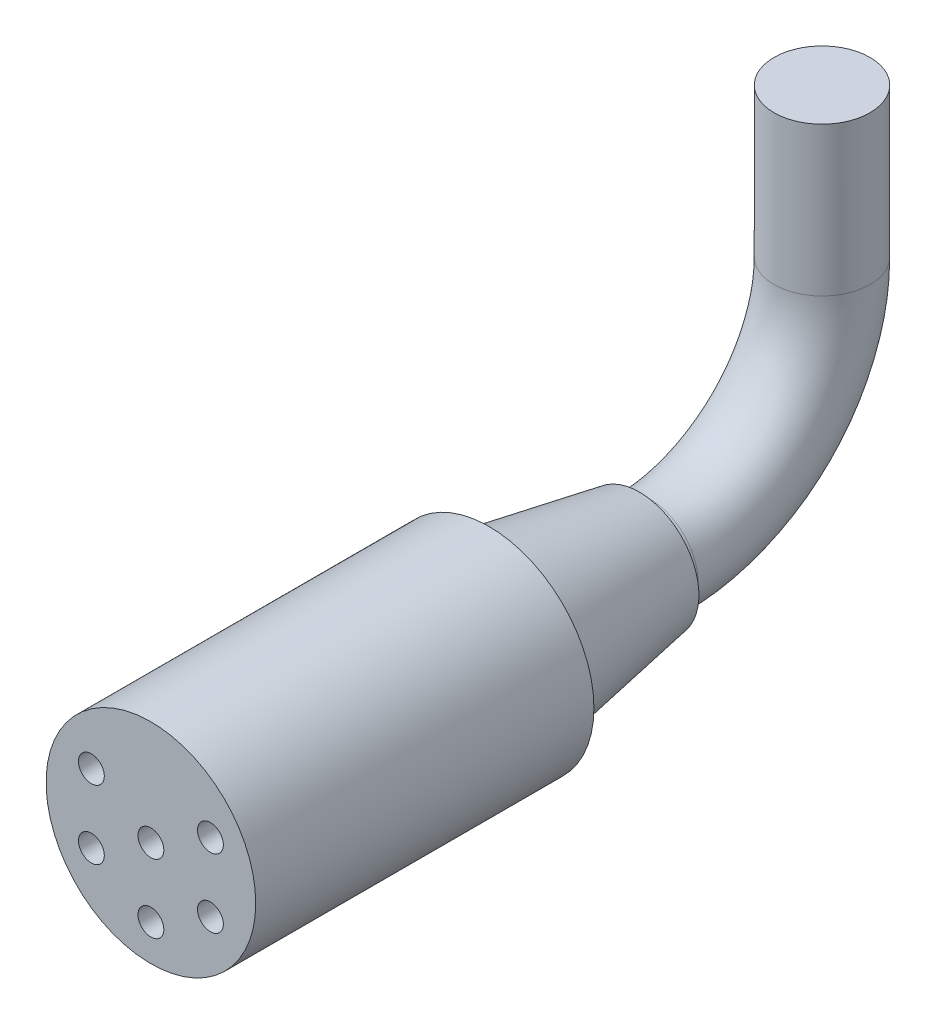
ISO-10303-21;
HEADER;
FILE_DESCRIPTION(('STEP AP214'),'2;1');
FILE_NAME('part.step','',(''),(''),'','','');
FILE_SCHEMA(('AUTOMOTIVE_DESIGN { 1 0 10303 214 1 1 1 1 }'));
ENDSEC;
DATA;
#1=APPLICATION_CONTEXT('core data for automotive mechanical design processes');
#2=APPLICATION_PROTOCOL_DEFINITION('international standard','automotive_design',2000,#1);
#3=PRODUCT_CONTEXT('',#1,'mechanical');
#4=PRODUCT('Part','Part','',(#3));
#5=PRODUCT_RELATED_PRODUCT_CATEGORY('part','',(#4));
#6=PRODUCT_DEFINITION_FORMATION('','',#4);
#7=PRODUCT_DEFINITION_CONTEXT('part definition',#1,'design');
#8=PRODUCT_DEFINITION('design','',#6,#7);
#9=PRODUCT_DEFINITION_SHAPE('','',#8);
#10=(LENGTH_UNIT() NAMED_UNIT(*) SI_UNIT(.MILLI.,.METRE.));
#11=(NAMED_UNIT(*) PLANE_ANGLE_UNIT() SI_UNIT($,.RADIAN.));
#12=(NAMED_UNIT(*) SI_UNIT($,.STERADIAN.) SOLID_ANGLE_UNIT());
#13=UNCERTAINTY_MEASURE_WITH_UNIT(LENGTH_MEASURE(1.E-05),#10,'distance_accuracy_value','');
#14=(GEOMETRIC_REPRESENTATION_CONTEXT(3) GLOBAL_UNCERTAINTY_ASSIGNED_CONTEXT((#13)) GLOBAL_UNIT_ASSIGNED_CONTEXT((#10,
#11,#12)) REPRESENTATION_CONTEXT('',''));
#15=CARTESIAN_POINT('',(0.,0.,0.));
#16=DIRECTION('',(0.,0.,1.));
#17=DIRECTION('',(1.,0.,0.));
#18=AXIS2_PLACEMENT_3D('',#15,#16,#17);
#19=CARTESIAN_POINT('',(0.,0.,-36.112500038));
#20=DIRECTION('',(0.,0.,-1.));
#21=DIRECTION('',(-1.,0.,0.));
#22=AXIS2_PLACEMENT_3D('',#19,#20,#21);
#23=PLANE('',#22);
#24=CARTESIAN_POINT('',(0.,0.,-36.112500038));
#25=DIRECTION('',(0.,0.,-1.));
#26=DIRECTION('',(-1.,0.,0.));
#27=AXIS2_PLACEMENT_3D('',#24,#25,#26);
#28=CIRCLE('',#27,4.39337397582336);
#29=CARTESIAN_POINT('',(-4.39337397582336,0.,-36.112500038));
#30=VERTEX_POINT('',#29);
#31=EDGE_CURVE('E87',#30,#30,#28,.T.);
#32=ORIENTED_EDGE('',*,*,#31,.T.);
#33=EDGE_LOOP('',(#32));
#34=FACE_BOUND('',#33,.T.);
#35=CARTESIAN_POINT('',(0.,0.,-36.112500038));
#36=DIRECTION('',(0.,0.,-1.));
#37=DIRECTION('',(-1.,0.,0.));
#38=AXIS2_PLACEMENT_3D('',#35,#36,#37);
#39=CIRCLE('',#38,3.5433);
#40=CARTESIAN_POINT('',(-3.5433,0.,-36.112500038));
#41=VERTEX_POINT('',#40);
#42=EDGE_CURVE('E93',#41,#41,#39,.T.);
#43=ORIENTED_EDGE('',*,*,#42,.F.);
#44=EDGE_LOOP('',(#43));
#45=FACE_BOUND('',#44,.T.);
#46=ADVANCED_FACE('F36',(#34,#45),#23,.T.);
#47=CARTESIAN_POINT('',(0.,0.,-25.000000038));
#48=DIRECTION('',(0.,0.,1.));
#49=DIRECTION('',(1.,0.,0.));
#50=AXIS2_PLACEMENT_3D('',#47,#48,#49);
#51=PLANE('',#50);
#52=CARTESIAN_POINT('',(0.,0.,-25.000000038));
#53=DIRECTION('',(0.,0.,1.));
#54=DIRECTION('',(1.,0.,0.));
#55=AXIS2_PLACEMENT_3D('',#52,#53,#54);
#56=CIRCLE('',#55,7.747);
#57=CARTESIAN_POINT('',(7.747,0.,-25.000000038));
#58=VERTEX_POINT('',#57);
#59=EDGE_CURVE('E43',#58,#58,#56,.T.);
#60=ORIENTED_EDGE('',*,*,#59,.F.);
#61=EDGE_LOOP('',(#60));
#62=FACE_BOUND('',#61,.T.);
#63=CARTESIAN_POINT('',(0.,0.,-25.000000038));
#64=DIRECTION('',(0.,0.,1.));
#65=DIRECTION('',(1.,0.,0.));
#66=AXIS2_PLACEMENT_3D('',#63,#64,#65);
#67=CIRCLE('',#66,6.35280754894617);
#68=CARTESIAN_POINT('',(6.35280754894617,0.,-25.000000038));
#69=VERTEX_POINT('',#68);
#70=EDGE_CURVE('E10',#69,#69,#67,.F.);
#71=ORIENTED_EDGE('',*,*,#70,.F.);
#72=EDGE_LOOP('',(#71));
#73=FACE_BOUND('',#72,.T.);
#74=ADVANCED_FACE('F127',(#62,#73),#51,.F.);
#75=CARTESIAN_POINT('',(0.,0.,-25.000000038));
#76=DIRECTION('',(0.,0.,1.));
#77=DIRECTION('',(1.,0.,0.));
#78=AXIS2_PLACEMENT_3D('',#75,#76,#77);
#79=CYLINDRICAL_SURFACE('',#78,7.747);
#80=ORIENTED_EDGE('',*,*,#59,.T.);
#81=EDGE_LOOP('',(#80));
#82=FACE_BOUND('',#81,.T.);
#83=CARTESIAN_POINT('',(0.,0.,0.));
#84=DIRECTION('',(0.,0.,1.));
#85=DIRECTION('',(1.,0.,0.));
#86=AXIS2_PLACEMENT_3D('',#83,#84,#85);
#87=CIRCLE('',#86,7.747);
#88=CARTESIAN_POINT('',(7.747,0.,0.));
#89=VERTEX_POINT('',#88);
#90=EDGE_CURVE('E47',#89,#89,#87,.T.);
#91=ORIENTED_EDGE('',*,*,#90,.F.);
#92=EDGE_LOOP('',(#91));
#93=FACE_BOUND('',#92,.T.);
#94=ADVANCED_FACE('F38',(#82,#93),#79,.T.);
#95=CARTESIAN_POINT('',(0.,0.,0.));
#96=DIRECTION('',(0.,0.,1.));
#97=DIRECTION('',(1.,0.,0.));
#98=AXIS2_PLACEMENT_3D('',#95,#96,#97);
#99=PLANE('',#98);
#100=CARTESIAN_POINT('',(0.,0.,0.));
#101=DIRECTION('',(0.,0.,1.));
#102=DIRECTION('',(1.,0.,0.));
#103=AXIS2_PLACEMENT_3D('',#100,#101,#102);
#104=CIRCLE('',#103,0.955);
#105=CARTESIAN_POINT('',(0.955,0.,0.));
#106=VERTEX_POINT('',#105);
#107=EDGE_CURVE('E84',#106,#106,#104,.T.);
#108=ORIENTED_EDGE('',*,*,#107,.F.);
#109=EDGE_LOOP('',(#108));
#110=FACE_BOUND('',#109,.T.);
#111=CARTESIAN_POINT('',(-4.39940905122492,-2.54000000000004,0.));
#112=DIRECTION('',(0.,0.,1.));
#113=DIRECTION('',(0.50000000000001,-0.866025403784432,0.));
#114=AXIS2_PLACEMENT_3D('',#111,#112,#113);
#115=CIRCLE('',#114,0.955);
#116=CARTESIAN_POINT('',(-3.92190905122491,-3.36705426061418,0.));
#117=VERTEX_POINT('',#116);
#118=EDGE_CURVE('E80',#117,#117,#115,.T.);
#119=ORIENTED_EDGE('',*,*,#118,.F.);
#120=EDGE_LOOP('',(#119));
#121=FACE_BOUND('',#120,.T.);
#122=CARTESIAN_POINT('',(-4.399409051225,2.53999999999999,0.));
#123=DIRECTION('',(0.,0.,1.));
#124=DIRECTION('',(-0.499999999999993,-0.866025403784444,0.));
#125=AXIS2_PLACEMENT_3D('',#122,#123,#124);
#126=CIRCLE('',#125,0.955);
#127=CARTESIAN_POINT('',(-4.876909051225,1.71294573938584,0.));
#128=VERTEX_POINT('',#127);
#129=EDGE_CURVE('E74',#128,#128,#126,.T.);
#130=ORIENTED_EDGE('',*,*,#129,.F.);
#131=EDGE_LOOP('',(#130));
#132=FACE_BOUND('',#131,.T.);
#133=CARTESIAN_POINT('',(4.39940905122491,2.54000000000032,0.));
#134=DIRECTION('',(0.,0.,1.));
#135=DIRECTION('',(-0.500000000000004,0.866025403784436,0.));
#136=AXIS2_PLACEMENT_3D('',#133,#134,#135);
#137=CIRCLE('',#136,0.955);
#138=CARTESIAN_POINT('',(3.9219090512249,3.36705426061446,0.));
#139=VERTEX_POINT('',#138);
#140=EDGE_CURVE('E68',#139,#139,#137,.T.);
#141=ORIENTED_EDGE('',*,*,#140,.F.);
#142=EDGE_LOOP('',(#141));
#143=FACE_BOUND('',#142,.T.);
#144=CARTESIAN_POINT('',(4.39940905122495,-2.53999999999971,0.));
#145=DIRECTION('',(0.,0.,1.));
#146=DIRECTION('',(0.499999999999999,0.86602540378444,0.));
#147=AXIS2_PLACEMENT_3D('',#144,#145,#146);
#148=CIRCLE('',#147,0.955);
#149=CARTESIAN_POINT('',(4.87690905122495,-1.71294573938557,0.));
#150=VERTEX_POINT('',#149);
#151=EDGE_CURVE('E62',#150,#150,#148,.T.);
#152=ORIENTED_EDGE('',*,*,#151,.F.);
#153=EDGE_LOOP('',(#152));
#154=FACE_BOUND('',#153,.T.);
#155=CARTESIAN_POINT('',(0.,-5.07999999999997,0.));
#156=DIRECTION('',(0.,0.,1.));
#157=DIRECTION('',(1.,0.,0.));
#158=AXIS2_PLACEMENT_3D('',#155,#156,#157);
#159=CIRCLE('',#158,0.955);
#160=CARTESIAN_POINT('',(0.955,-5.07999999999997,0.));
#161=VERTEX_POINT('',#160);
#162=EDGE_CURVE('E54',#161,#161,#159,.T.);
#163=ORIENTED_EDGE('',*,*,#162,.F.);
#164=EDGE_LOOP('',(#163));
#165=FACE_BOUND('',#164,.T.);
#166=ORIENTED_EDGE('',*,*,#90,.T.);
#167=EDGE_LOOP('',(#166));
#168=FACE_BOUND('',#167,.T.);
#169=ADVANCED_FACE('F185',(#110,#121,#132,#143,#154,#165,#168),#99,.T.);
#170=CARTESIAN_POINT('',(0.,-5.07999999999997,-10.));
#171=DIRECTION('',(0.,0.,1.));
#172=DIRECTION('',(1.,0.,0.));
#173=AXIS2_PLACEMENT_3D('',#170,#171,#172);
#174=CYLINDRICAL_SURFACE('',#173,0.955);
#175=CARTESIAN_POINT('',(0.,-5.07999999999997,-10.));
#176=DIRECTION('',(0.,0.,1.));
#177=DIRECTION('',(1.,0.,0.));
#178=AXIS2_PLACEMENT_3D('',#175,#176,#177);
#179=CIRCLE('',#178,0.955);
#180=CARTESIAN_POINT('',(0.955,-5.07999999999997,-10.));
#181=VERTEX_POINT('',#180);
#182=EDGE_CURVE('E52',#181,#181,#179,.T.);
#183=ORIENTED_EDGE('',*,*,#182,.F.);
#184=EDGE_LOOP('',(#183));
#185=FACE_BOUND('',#184,.T.);
#186=ORIENTED_EDGE('',*,*,#162,.T.);
#187=EDGE_LOOP('',(#186));
#188=FACE_BOUND('',#187,.T.);
#189=ADVANCED_FACE('F182',(#185,#188),#174,.F.);
#190=CARTESIAN_POINT('',(0.,-5.07999999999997,-10.));
#191=DIRECTION('',(0.,0.,1.));
#192=DIRECTION('',(1.,0.,0.));
#193=AXIS2_PLACEMENT_3D('',#190,#191,#192);
#194=PLANE('',#193);
#195=ORIENTED_EDGE('',*,*,#182,.T.);
#196=EDGE_LOOP('',(#195));
#197=FACE_BOUND('',#196,.T.);
#198=ADVANCED_FACE('F176',(#197),#194,.T.);
#199=CARTESIAN_POINT('',(4.39940905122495,-2.53999999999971,-10.));
#200=DIRECTION('',(0.,0.,1.));
#201=DIRECTION('',(0.499999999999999,0.86602540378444,0.));
#202=AXIS2_PLACEMENT_3D('',#199,#200,#201);
#203=CYLINDRICAL_SURFACE('',#202,0.955);
#204=CARTESIAN_POINT('',(4.39940905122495,-2.53999999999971,-10.));
#205=DIRECTION('',(0.,0.,1.));
#206=DIRECTION('',(0.499999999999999,0.86602540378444,0.));
#207=AXIS2_PLACEMENT_3D('',#204,#205,#206);
#208=CIRCLE('',#207,0.955);
#209=CARTESIAN_POINT('',(4.87690905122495,-1.71294573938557,-10.));
#210=VERTEX_POINT('',#209);
#211=EDGE_CURVE('E57',#210,#210,#208,.T.);
#212=ORIENTED_EDGE('',*,*,#211,.F.);
#213=EDGE_LOOP('',(#212));
#214=FACE_BOUND('',#213,.T.);
#215=ORIENTED_EDGE('',*,*,#151,.T.);
#216=EDGE_LOOP('',(#215));
#217=FACE_BOUND('',#216,.T.);
#218=ADVANCED_FACE('F168',(#214,#217),#203,.F.);
#219=CARTESIAN_POINT('',(4.39940905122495,-2.53999999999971,-10.));
#220=DIRECTION('',(0.,0.,1.));
#221=DIRECTION('',(0.499999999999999,0.86602540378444,0.));
#222=AXIS2_PLACEMENT_3D('',#219,#220,#221);
#223=PLANE('',#222);
#224=ORIENTED_EDGE('',*,*,#211,.T.);
#225=EDGE_LOOP('',(#224));
#226=FACE_BOUND('',#225,.T.);
#227=ADVANCED_FACE('F171',(#226),#223,.T.);
#228=CARTESIAN_POINT('',(4.39940905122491,2.54000000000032,-10.));
#229=DIRECTION('',(0.,0.,1.));
#230=DIRECTION('',(-0.500000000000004,0.866025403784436,0.));
#231=AXIS2_PLACEMENT_3D('',#228,#229,#230);
#232=CYLINDRICAL_SURFACE('',#231,0.955);
#233=CARTESIAN_POINT('',(4.39940905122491,2.54000000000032,-10.));
#234=DIRECTION('',(0.,0.,1.));
#235=DIRECTION('',(-0.500000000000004,0.866025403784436,0.));
#236=AXIS2_PLACEMENT_3D('',#233,#234,#235);
#237=CIRCLE('',#236,0.955);
#238=CARTESIAN_POINT('',(3.9219090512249,3.36705426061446,-10.));
#239=VERTEX_POINT('',#238);
#240=EDGE_CURVE('E65',#239,#239,#237,.T.);
#241=ORIENTED_EDGE('',*,*,#240,.F.);
#242=EDGE_LOOP('',(#241));
#243=FACE_BOUND('',#242,.T.);
#244=ORIENTED_EDGE('',*,*,#140,.T.);
#245=EDGE_LOOP('',(#244));
#246=FACE_BOUND('',#245,.T.);
#247=ADVANCED_FACE('F160',(#243,#246),#232,.F.);
#248=CARTESIAN_POINT('',(4.39940905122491,2.54000000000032,-10.));
#249=DIRECTION('',(0.,0.,1.));
#250=DIRECTION('',(-0.500000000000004,0.866025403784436,0.));
#251=AXIS2_PLACEMENT_3D('',#248,#249,#250);
#252=PLANE('',#251);
#253=ORIENTED_EDGE('',*,*,#240,.T.);
#254=EDGE_LOOP('',(#253));
#255=FACE_BOUND('',#254,.T.);
#256=ADVANCED_FACE('F163',(#255),#252,.T.);
#257=CARTESIAN_POINT('',(-4.399409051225,2.53999999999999,-10.));
#258=DIRECTION('',(0.,0.,1.));
#259=DIRECTION('',(-0.499999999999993,-0.866025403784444,0.));
#260=AXIS2_PLACEMENT_3D('',#257,#258,#259);
#261=CYLINDRICAL_SURFACE('',#260,0.955);
#262=CARTESIAN_POINT('',(-4.399409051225,2.53999999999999,-10.));
#263=DIRECTION('',(0.,0.,1.));
#264=DIRECTION('',(-0.499999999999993,-0.866025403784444,0.));
#265=AXIS2_PLACEMENT_3D('',#262,#263,#264);
#266=CIRCLE('',#265,0.955);
#267=CARTESIAN_POINT('',(-4.876909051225,1.71294573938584,-10.));
#268=VERTEX_POINT('',#267);
#269=EDGE_CURVE('E71',#268,#268,#266,.T.);
#270=ORIENTED_EDGE('',*,*,#269,.F.);
#271=EDGE_LOOP('',(#270));
#272=FACE_BOUND('',#271,.T.);
#273=ORIENTED_EDGE('',*,*,#129,.T.);
#274=EDGE_LOOP('',(#273));
#275=FACE_BOUND('',#274,.T.);
#276=ADVANCED_FACE('F152',(#272,#275),#261,.F.);
#277=CARTESIAN_POINT('',(-4.399409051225,2.53999999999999,-10.));
#278=DIRECTION('',(0.,0.,1.));
#279=DIRECTION('',(-0.499999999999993,-0.866025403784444,0.));
#280=AXIS2_PLACEMENT_3D('',#277,#278,#279);
#281=PLANE('',#280);
#282=ORIENTED_EDGE('',*,*,#269,.T.);
#283=EDGE_LOOP('',(#282));
#284=FACE_BOUND('',#283,.T.);
#285=ADVANCED_FACE('F155',(#284),#281,.T.);
#286=CARTESIAN_POINT('',(-4.39940905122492,-2.54000000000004,-10.));
#287=DIRECTION('',(0.,0.,1.));
#288=DIRECTION('',(0.50000000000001,-0.866025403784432,0.));
#289=AXIS2_PLACEMENT_3D('',#286,#287,#288);
#290=CYLINDRICAL_SURFACE('',#289,0.955);
#291=CARTESIAN_POINT('',(-4.39940905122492,-2.54000000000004,-10.));
#292=DIRECTION('',(0.,0.,1.));
#293=DIRECTION('',(0.50000000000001,-0.866025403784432,0.));
#294=AXIS2_PLACEMENT_3D('',#291,#292,#293);
#295=CIRCLE('',#294,0.955);
#296=CARTESIAN_POINT('',(-3.92190905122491,-3.36705426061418,-10.));
#297=VERTEX_POINT('',#296);
#298=EDGE_CURVE('E77',#297,#297,#295,.T.);
#299=ORIENTED_EDGE('',*,*,#298,.F.);
#300=EDGE_LOOP('',(#299));
#301=FACE_BOUND('',#300,.T.);
#302=ORIENTED_EDGE('',*,*,#118,.T.);
#303=EDGE_LOOP('',(#302));
#304=FACE_BOUND('',#303,.T.);
#305=ADVANCED_FACE('F148',(#301,#304),#290,.F.);
#306=CARTESIAN_POINT('',(-4.39940905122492,-2.54000000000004,-10.));
#307=DIRECTION('',(0.,0.,1.));
#308=DIRECTION('',(0.50000000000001,-0.866025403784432,0.));
#309=AXIS2_PLACEMENT_3D('',#306,#307,#308);
#310=PLANE('',#309);
#311=ORIENTED_EDGE('',*,*,#298,.T.);
#312=EDGE_LOOP('',(#311));
#313=FACE_BOUND('',#312,.T.);
#314=ADVANCED_FACE('F146',(#313),#310,.T.);
#315=CARTESIAN_POINT('',(0.,0.,-10.));
#316=DIRECTION('',(0.,0.,1.));
#317=DIRECTION('',(1.,0.,0.));
#318=AXIS2_PLACEMENT_3D('',#315,#316,#317);
#319=CYLINDRICAL_SURFACE('',#318,0.955);
#320=CARTESIAN_POINT('',(0.,0.,-10.));
#321=DIRECTION('',(0.,0.,1.));
#322=DIRECTION('',(1.,0.,0.));
#323=AXIS2_PLACEMENT_3D('',#320,#321,#322);
#324=CIRCLE('',#323,0.955);
#325=CARTESIAN_POINT('',(0.955,0.,-10.));
#326=VERTEX_POINT('',#325);
#327=EDGE_CURVE('E83',#326,#326,#324,.T.);
#328=ORIENTED_EDGE('',*,*,#327,.F.);
#329=EDGE_LOOP('',(#328));
#330=FACE_BOUND('',#329,.T.);
#331=ORIENTED_EDGE('',*,*,#107,.T.);
#332=EDGE_LOOP('',(#331));
#333=FACE_BOUND('',#332,.T.);
#334=ADVANCED_FACE('F142',(#330,#333),#319,.F.);
#335=CARTESIAN_POINT('',(0.,0.,-10.));
#336=DIRECTION('',(0.,0.,1.));
#337=DIRECTION('',(1.,0.,0.));
#338=AXIS2_PLACEMENT_3D('',#335,#336,#337);
#339=PLANE('',#338);
#340=ORIENTED_EDGE('',*,*,#327,.T.);
#341=EDGE_LOOP('',(#340));
#342=FACE_BOUND('',#341,.T.);
#343=ADVANCED_FACE('F138',(#342),#339,.T.);
#344=CARTESIAN_POINT('',(0.,0.,-25.000000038));
#345=DIRECTION('',(0.,0.,1.));
#346=DIRECTION('',(-1.,0.,0.));
#347=AXIS2_PLACEMENT_3D('',#344,#345,#346);
#348=CONICAL_SURFACE('',#347,6.35280754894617,0.174532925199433);
#349=ORIENTED_EDGE('',*,*,#31,.F.);
#350=EDGE_LOOP('',(#349));
#351=FACE_BOUND('',#350,.T.);
#352=ORIENTED_EDGE('',*,*,#70,.T.);
#353=EDGE_LOOP('',(#352));
#354=FACE_BOUND('',#353,.T.);
#355=ADVANCED_FACE('F122',(#351,#354),#348,.T.);
#356=CARTESIAN_POINT('',(0.,0.,-36.906250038));
#357=DIRECTION('',(0.,0.,1.));
#358=DIRECTION('',(1.,0.,0.));
#359=AXIS2_PLACEMENT_3D('',#356,#357,#358);
#360=CYLINDRICAL_SURFACE('',#359,3.5433);
#361=CARTESIAN_POINT('',(0.,0.,-36.906250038));
#362=DIRECTION('',(0.,0.,-1.));
#363=DIRECTION('',(-1.,0.,0.));
#364=AXIS2_PLACEMENT_3D('',#361,#362,#363);
#365=CIRCLE('',#364,3.5433);
#366=CARTESIAN_POINT('',(0.,-3.54330000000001,-36.906250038));
#367=VERTEX_POINT('',#366);
#368=EDGE_CURVE('E92',#367,#367,#365,.T.);
#369=ORIENTED_EDGE('',*,*,#368,.F.);
#370=EDGE_LOOP('',(#369));
#371=FACE_BOUND('',#370,.T.);
#372=ORIENTED_EDGE('',*,*,#42,.T.);
#373=EDGE_LOOP('',(#372));
#374=FACE_BOUND('',#373,.T.);
#375=ADVANCED_FACE('F116',(#371,#374),#360,.T.);
#376=CARTESIAN_POINT('',(0.,12.7,-36.906250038));
#377=DIRECTION('',(-1.,0.,0.));
#378=DIRECTION('',(0.,-1.,0.));
#379=AXIS2_PLACEMENT_3D('',#376,#377,#378);
#380=TOROIDAL_SURFACE('',#379,12.7,3.5433);
#381=CARTESIAN_POINT('',(0.,12.7,-49.606250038));
#382=DIRECTION('',(0.,1.,0.));
#383=DIRECTION('',(-1.,0.,0.));
#384=AXIS2_PLACEMENT_3D('',#381,#382,#383);
#385=CIRCLE('',#384,3.5433);
#386=CARTESIAN_POINT('',(0.,12.7000000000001,-53.149550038));
#387=VERTEX_POINT('',#386);
#388=EDGE_CURVE('E96',#387,#387,#385,.T.);
#389=CARTESIAN_POINT('',(0.,12.7,-36.906250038));
#390=DIRECTION('',(-1.,0.,0.));
#391=DIRECTION('',(0.,-1.,0.));
#392=AXIS2_PLACEMENT_3D('',#389,#390,#391);
#393=CIRCLE('',#392,16.2433);
#394=EDGE_CURVE('',#387,#367,#393,.T.);
#395=ORIENTED_EDGE('',*,*,#388,.F.);
#396=ORIENTED_EDGE('',*,*,#368,.T.);
#397=ORIENTED_EDGE('',*,*,#394,.T.);
#398=ORIENTED_EDGE('',*,*,#394,.F.);
#399=EDGE_LOOP('',(#395,#397,#396,#398));
#400=FACE_BOUND('',#399,.T.);
#401=ADVANCED_FACE('F110',(#400),#380,.T.);
#402=CARTESIAN_POINT('',(0.,23.7000000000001,-49.6062500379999));
#403=DIRECTION('',(0.,-1.,0.));
#404=DIRECTION('',(0.,0.,-1.));
#405=AXIS2_PLACEMENT_3D('',#402,#403,#404);
#406=CYLINDRICAL_SURFACE('',#405,3.5433);
#407=CARTESIAN_POINT('',(0.,23.7000000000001,-49.6062500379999));
#408=DIRECTION('',(0.,1.,0.));
#409=DIRECTION('',(0.,0.,1.));
#410=AXIS2_PLACEMENT_3D('',#407,#408,#409);
#411=CIRCLE('',#410,3.5433);
#412=CARTESIAN_POINT('',(0.,23.7,-46.0629500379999));
#413=VERTEX_POINT('',#412);
#414=EDGE_CURVE('E101',#413,#413,#411,.T.);
#415=ORIENTED_EDGE('',*,*,#414,.F.);
#416=EDGE_LOOP('',(#415));
#417=FACE_BOUND('',#416,.T.);
#418=ORIENTED_EDGE('',*,*,#388,.T.);
#419=EDGE_LOOP('',(#418));
#420=FACE_BOUND('',#419,.T.);
#421=ADVANCED_FACE('F107',(#417,#420),#406,.T.);
#422=CARTESIAN_POINT('',(0.,23.7000000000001,-49.6062500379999));
#423=DIRECTION('',(0.,1.,0.));
#424=DIRECTION('',(0.,0.,1.));
#425=AXIS2_PLACEMENT_3D('',#422,#423,#424);
#426=PLANE('',#425);
#427=ORIENTED_EDGE('',*,*,#414,.T.);
#428=EDGE_LOOP('',(#427));
#429=FACE_BOUND('',#428,.T.);
#430=ADVANCED_FACE('F105',(#429),#426,.T.);
#431=CLOSED_SHELL('',(#46,#74,#94,#169,#189,#198,#218,#227,#247,#256,#276,#285,#305,#314,#334,
#343,#355,#375,#401,#421,#430));
#432=MANIFOLD_SOLID_BREP('B2',#431);
#433=ADVANCED_BREP_SHAPE_REPRESENTATION('',(#18,#432),#14);
#434=SHAPE_DEFINITION_REPRESENTATION(#9,#433);
ENDSEC;
END-ISO-10303-21;
